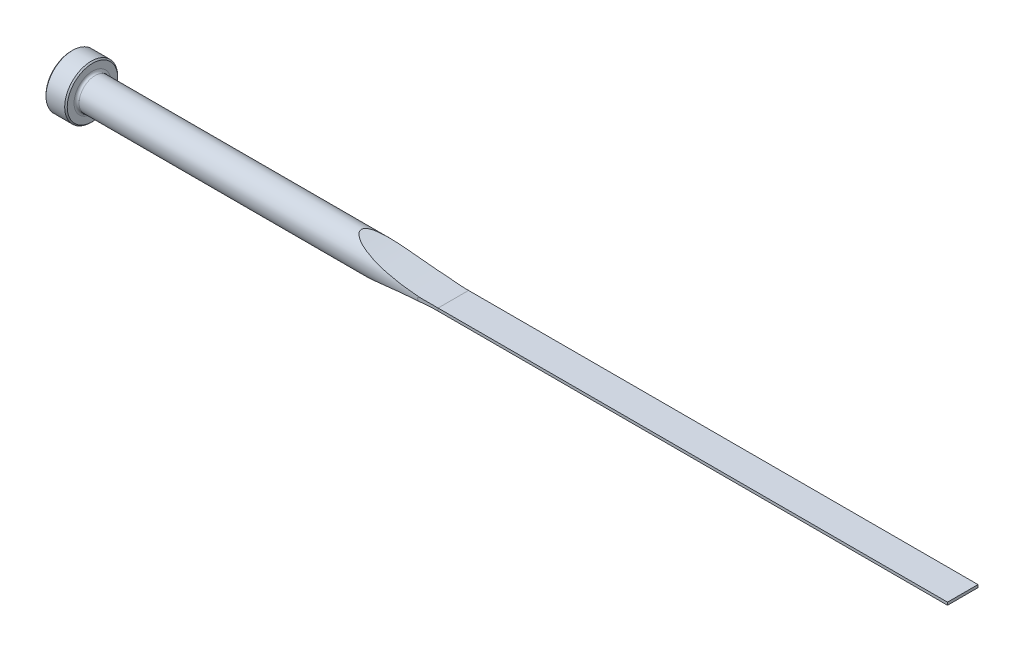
ISO-10303-21;
HEADER;
FILE_DESCRIPTION(('STEP AP214'),'2;1');
FILE_NAME('part.step','',(''),(''),'','','');
FILE_SCHEMA(('AUTOMOTIVE_DESIGN { 1 0 10303 214 1 1 1 1 }'));
ENDSEC;
DATA;
#1=APPLICATION_CONTEXT('core data for automotive mechanical design processes');
#2=APPLICATION_PROTOCOL_DEFINITION('international standard','automotive_design',2000,#1);
#3=PRODUCT_CONTEXT('',#1,'mechanical');
#4=PRODUCT('Part','Part','',(#3));
#5=PRODUCT_RELATED_PRODUCT_CATEGORY('part','',(#4));
#6=PRODUCT_DEFINITION_FORMATION('','',#4);
#7=PRODUCT_DEFINITION_CONTEXT('part definition',#1,'design');
#8=PRODUCT_DEFINITION('design','',#6,#7);
#9=PRODUCT_DEFINITION_SHAPE('','',#8);
#10=(LENGTH_UNIT() NAMED_UNIT(*) SI_UNIT(.MILLI.,.METRE.));
#11=(NAMED_UNIT(*) PLANE_ANGLE_UNIT() SI_UNIT($,.RADIAN.));
#12=(NAMED_UNIT(*) SI_UNIT($,.STERADIAN.) SOLID_ANGLE_UNIT());
#13=UNCERTAINTY_MEASURE_WITH_UNIT(LENGTH_MEASURE(1.E-05),#10,'distance_accuracy_value','');
#14=(GEOMETRIC_REPRESENTATION_CONTEXT(3) GLOBAL_UNCERTAINTY_ASSIGNED_CONTEXT((#13)) GLOBAL_UNIT_ASSIGNED_CONTEXT((#10,
#11,#12)) REPRESENTATION_CONTEXT('',''));
#15=CARTESIAN_POINT('',(0.,0.,0.));
#16=DIRECTION('',(0.,0.,1.));
#17=DIRECTION('',(1.,0.,0.));
#18=AXIS2_PLACEMENT_3D('',#15,#16,#17);
#19=CARTESIAN_POINT('',(0.,0.,0.));
#20=DIRECTION('',(-1.,0.,0.));
#21=DIRECTION('',(0.,0.,1.));
#22=AXIS2_PLACEMENT_3D('',#19,#20,#21);
#23=CYLINDRICAL_SURFACE('',#22,4.7625);
#24=CARTESIAN_POINT('',(7.112,0.,0.));
#25=DIRECTION('',(-1.,0.,0.));
#26=DIRECTION('',(0.,0.,1.));
#27=AXIS2_PLACEMENT_3D('',#24,#25,#26);
#28=CIRCLE('',#27,4.7625);
#29=CARTESIAN_POINT('',(7.112,0.,4.7625));
#30=VERTEX_POINT('',#29);
#31=EDGE_CURVE('E153',#30,#30,#28,.F.);
#32=ORIENTED_EDGE('',*,*,#31,.T.);
#33=EDGE_LOOP('',(#32));
#34=FACE_BOUND('',#33,.T.);
#35=CARTESIAN_POINT('',(114.3,1.37629566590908,4.55929999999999));
#36=CARTESIAN_POINT('',(114.100243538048,1.37627017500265,4.55929946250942));
#37=CARTESIAN_POINT('',(113.900483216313,1.37406392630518,4.55997325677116));
#38=CARTESIAN_POINT('',(113.501024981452,1.36511039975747,4.56266611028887));
#39=CARTESIAN_POINT('',(113.301327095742,1.35836200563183,4.56468550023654));
#40=CARTESIAN_POINT('',(112.900347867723,1.34006170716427,4.57009060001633));
#41=CARTESIAN_POINT('',(112.699068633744,1.32846669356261,4.57348856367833));
#42=CARTESIAN_POINT('',(112.296928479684,1.30007175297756,4.58164172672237));
#43=CARTESIAN_POINT('',(112.096067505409,1.28327254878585,4.58639673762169));
#44=CARTESIAN_POINT('',(111.696176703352,1.24395343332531,4.59721659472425));
#45=CARTESIAN_POINT('',(111.497143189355,1.22146913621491,4.60327325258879));
#46=CARTESIAN_POINT('',(111.099904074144,1.16973426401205,4.6166926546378));
#47=CARTESIAN_POINT('',(110.90169881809,1.1404811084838,4.62405589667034));
#48=CARTESIAN_POINT('',(110.507485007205,1.07370926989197,4.640013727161));
#49=CARTESIAN_POINT('',(110.311471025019,1.03622172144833,4.64860363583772));
#50=CARTESIAN_POINT('',(109.921964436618,0.950234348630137,4.66695416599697));
#51=CARTESIAN_POINT('',(109.728469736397,0.901744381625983,4.67671373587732));
#52=CARTESIAN_POINT('',(109.489568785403,0.830609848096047,4.68952997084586));
#53=CARTESIAN_POINT('',(109.441796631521,0.815810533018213,4.69213189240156));
#54=CARTESIAN_POINT('',(109.346645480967,0.784967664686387,4.69739068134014));
#55=CARTESIAN_POINT('',(109.29926657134,0.768923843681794,4.70004756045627));
#56=CARTESIAN_POINT('',(109.157175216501,0.71840494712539,4.70812874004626));
#57=CARTESIAN_POINT('',(109.063234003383,0.681752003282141,4.71362458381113));
#58=CARTESIAN_POINT('',(108.877534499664,0.599731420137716,4.72477713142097));
#59=CARTESIAN_POINT('',(108.785820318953,0.554256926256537,4.73043499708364));
#60=CARTESIAN_POINT('',(108.654614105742,0.476034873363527,4.73871868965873));
#61=CARTESIAN_POINT('',(108.612099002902,0.448424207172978,4.7414354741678));
#62=CARTESIAN_POINT('',(108.530424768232,0.388667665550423,4.74670987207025));
#63=CARTESIAN_POINT('',(108.491254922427,0.35653721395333,4.74926798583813));
#64=CARTESIAN_POINT('',(108.434384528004,0.301094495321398,4.75301502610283));
#65=CARTESIAN_POINT('',(108.414664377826,0.279884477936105,4.75432176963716));
#66=CARTESIAN_POINT('',(108.378171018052,0.235020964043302,4.75675058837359));
#67=CARTESIAN_POINT('',(108.361393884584,0.211370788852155,4.75787290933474));
#68=CARTESIAN_POINT('',(108.336135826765,0.16808537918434,4.75956809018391));
#69=CARTESIAN_POINT('',(108.326635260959,0.149056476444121,4.76020769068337));
#70=CARTESIAN_POINT('',(108.31078402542,0.109713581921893,4.76127659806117));
#71=CARTESIAN_POINT('',(108.304429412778,0.0894012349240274,4.76170616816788));
#72=CARTESIAN_POINT('',(108.295545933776,0.0476995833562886,4.76230708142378));
#73=CARTESIAN_POINT('',(108.293058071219,0.0263011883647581,4.76247565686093));
#74=CARTESIAN_POINT('',(108.292412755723,-0.0165581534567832,4.76251936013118));
#75=CARTESIAN_POINT('',(108.294253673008,-0.0380190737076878,4.76239459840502));
#76=CARTESIAN_POINT('',(108.30142234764,-0.0771509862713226,4.76190953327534));
#77=CARTESIAN_POINT('',(108.306214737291,-0.0949256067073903,4.76158540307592));
#78=CARTESIAN_POINT('',(108.318318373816,-0.129583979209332,4.76076832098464));
#79=CARTESIAN_POINT('',(108.325631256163,-0.146467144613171,4.76027525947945));
#80=CARTESIAN_POINT('',(108.347823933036,-0.190109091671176,4.75878258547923));
#81=CARTESIAN_POINT('',(108.364497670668,-0.21594512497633,4.75766444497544));
#82=CARTESIAN_POINT('',(108.401515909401,-0.264813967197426,4.75519504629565));
#83=CARTESIAN_POINT('',(108.421871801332,-0.287837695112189,4.75384306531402));
#84=CARTESIAN_POINT('',(108.486246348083,-0.353109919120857,4.74959319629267));
#85=CARTESIAN_POINT('',(108.5337556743,-0.391849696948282,4.74648889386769));
#86=CARTESIAN_POINT('',(108.633252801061,-0.462955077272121,4.74007706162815));
#87=CARTESIAN_POINT('',(108.685255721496,-0.495297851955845,4.73676885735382));
#88=CARTESIAN_POINT('',(108.832460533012,-0.57848482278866,4.72754240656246));
#89=CARTESIAN_POINT('',(108.930312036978,-0.624585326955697,4.72156110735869));
#90=CARTESIAN_POINT('',(109.129656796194,-0.708279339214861,4.70972175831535));
#91=CARTESIAN_POINT('',(109.231158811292,-0.745850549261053,4.70386406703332));
#92=CARTESIAN_POINT('',(109.437175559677,-0.815246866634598,4.69233729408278));
#93=CARTESIAN_POINT('',(109.54170965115,-0.847014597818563,4.68667050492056));
#94=CARTESIAN_POINT('',(109.751931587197,-0.905852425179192,4.67565197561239));
#95=CARTESIAN_POINT('',(109.857617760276,-0.93292855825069,4.67029983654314));
#96=CARTESIAN_POINT('',(110.147207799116,-1.00180171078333,4.65615804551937));
#97=CARTESIAN_POINT('',(110.331993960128,-1.03994988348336,4.64770520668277));
#98=CARTESIAN_POINT('',(110.703115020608,-1.10820041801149,4.63190013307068));
#99=CARTESIAN_POINT('',(110.889450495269,-1.13829964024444,4.62454832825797));
#100=CARTESIAN_POINT('',(111.263496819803,-1.19209136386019,4.61097562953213));
#101=CARTESIAN_POINT('',(111.451209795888,-1.21576959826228,4.60475726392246));
#102=CARTESIAN_POINT('',(111.827286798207,-1.25764094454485,4.5934961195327));
#103=CARTESIAN_POINT('',(112.015650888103,-1.27583350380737,4.58845345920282));
#104=CARTESIAN_POINT('',(112.553477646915,-1.32086317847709,4.5757714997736));
#105=CARTESIAN_POINT('',(112.903477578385,-1.34186157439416,4.56957976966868));
#106=CARTESIAN_POINT('',(113.428033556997,-1.36263417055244,4.56340533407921));
#107=CARTESIAN_POINT('',(113.602391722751,-1.3677712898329,4.56186604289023));
#108=CARTESIAN_POINT('',(113.951163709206,-1.37459791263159,4.55981341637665));
#109=CARTESIAN_POINT('',(114.125577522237,-1.37628777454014,4.55929997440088));
#110=CARTESIAN_POINT('',(114.3,-1.37629566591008,4.55929999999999));
#111=B_SPLINE_CURVE_WITH_KNOTS('',3,(#35,#36,#37,#38,#39,#40,#41,#42,#43,#44,#45,#46,#47,#48,
#49,#50,#51,#52,#53,#54,#55,#56,#57,#58,#59,#60,#61,#62,#63,#64,#65,#66,#67,#68,#69,#70,#71,#72,
#73,#74,#75,#76,#77,#78,#79,#80,#81,#82,#83,#84,#85,#86,#87,#88,#89,#90,#91,#92,#93,#94,#95,#96,
#97,#98,#99,#100,#101,#102,#103,#104,#105,#106,#107,#108,#109,#110),.UNSPECIFIED.,.F.,.F.,(4,2,
2,2,2,2,2,2,2,2,2,2,2,2,2,2,2,2,2,2,2,2,2,2,2,2,2,2,2,2,2,2,2,2,2,2,2,4),(0.,0.599262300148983,
1.19867192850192,1.80353056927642,2.40830524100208,3.00938132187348,3.61068692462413,
4.20975694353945,4.80829234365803,4.95851786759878,5.10877580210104,5.41155733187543,
5.71826557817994,5.87039269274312,6.02201272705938,6.10881533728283,6.19550132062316,
6.2591195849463,6.32265791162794,6.38686552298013,6.45104896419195,6.50606849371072,
6.56112379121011,6.65289509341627,6.74495530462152,6.92807013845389,7.11182707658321,
7.43597686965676,7.76096456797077,8.08900931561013,8.41662876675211,8.98296372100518,
9.54951926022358,10.117323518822,10.6851849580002,11.7368092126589,12.26010406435,
12.7833445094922),.UNSPECIFIED.);
#112=CARTESIAN_POINT('',(108.830915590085,0.574787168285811,4.72768716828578));
#113=VERTEX_POINT('',#112);
#114=CARTESIAN_POINT('',(108.830915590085,-0.574787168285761,4.72768716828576));
#115=VERTEX_POINT('',#114);
#116=EDGE_CURVE('E156',#113,#115,#111,.T.);
#117=ORIENTED_EDGE('',*,*,#116,.F.);
#118=CARTESIAN_POINT('',(114.3,0.406399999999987,4.74512858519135));
#119=CARTESIAN_POINT('',(113.90267450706,0.406399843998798,4.7451190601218));
#120=CARTESIAN_POINT('',(113.505349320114,0.409063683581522,4.74490020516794));
#121=CARTESIAN_POINT('',(112.710770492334,0.419718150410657,4.74397463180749));
#122=CARTESIAN_POINT('',(112.313516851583,0.427708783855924,4.74326791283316));
#123=CARTESIAN_POINT('',(111.519127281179,0.449016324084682,4.74129734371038));
#124=CARTESIAN_POINT('',(111.121991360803,0.462333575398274,4.74003345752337));
#125=CARTESIAN_POINT('',(110.327939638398,0.494291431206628,4.73680639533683));
#126=CARTESIAN_POINT('',(109.931023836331,0.512932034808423,4.73484321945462));
#127=CARTESIAN_POINT('',(108.739456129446,0.576901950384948,4.72763012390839));
#128=CARTESIAN_POINT('',(107.945225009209,0.63024609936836,4.72105865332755));
#129=CARTESIAN_POINT('',(106.358589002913,0.758235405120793,4.70219684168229));
#130=CARTESIAN_POINT('',(105.56618404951,0.832879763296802,4.68990671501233));
#131=CARTESIAN_POINT('',(103.983552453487,1.00343011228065,4.65640758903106));
#132=CARTESIAN_POINT('',(103.193326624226,1.09934317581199,4.63519562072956));
#133=CARTESIAN_POINT('',(102.010444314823,1.25905368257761,4.59338453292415));
#134=CARTESIAN_POINT('',(101.616527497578,1.31493588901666,4.57778029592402));
#135=CARTESIAN_POINT('',(100.829658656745,1.43195490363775,4.54253855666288));
#136=CARTESIAN_POINT('',(100.436706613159,1.4930916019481,4.52290113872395));
#137=CARTESIAN_POINT('',(99.6518575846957,1.62059720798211,4.47879686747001));
#138=CARTESIAN_POINT('',(99.2599607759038,1.68696693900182,4.45432925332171));
#139=CARTESIAN_POINT('',(98.4774903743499,1.82488195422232,4.39962705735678));
#140=CARTESIAN_POINT('',(98.0869167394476,1.89642707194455,4.36939266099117));
#141=CARTESIAN_POINT('',(97.3074212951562,2.04461214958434,4.30204521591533));
#142=CARTESIAN_POINT('',(96.9184991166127,2.12125089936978,4.26493379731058));
#143=CARTESIAN_POINT('',(96.1425664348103,2.27953993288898,4.18247202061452));
#144=CARTESIAN_POINT('',(95.7555558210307,2.3611899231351,4.13712214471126));
#145=CARTESIAN_POINT('',(94.9831933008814,2.52951682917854,4.03640907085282));
#146=CARTESIAN_POINT('',(94.5978455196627,2.61620235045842,3.98102836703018));
#147=CARTESIAN_POINT('',(93.8301002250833,2.79427071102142,3.858130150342));
#148=CARTESIAN_POINT('',(93.447703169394,2.88565426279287,3.79061079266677));
#149=CARTESIAN_POINT('',(92.6876227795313,3.07260204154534,3.64072869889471));
#150=CARTESIAN_POINT('',(92.3099315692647,3.16815757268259,3.55839581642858));
#151=CARTESIAN_POINT('',(91.7476753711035,3.31430622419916,3.4207048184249));
#152=CARTESIAN_POINT('',(91.5609951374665,3.36348479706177,3.37245005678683));
#153=CARTESIAN_POINT('',(91.1893485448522,3.46267714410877,3.27052654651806));
#154=CARTESIAN_POINT('',(91.0043820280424,3.51269084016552,3.21685830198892));
#155=CARTESIAN_POINT('',(90.6792293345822,3.60172890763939,3.1164639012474));
#156=CARTESIAN_POINT('',(90.5386096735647,3.64061088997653,3.07101578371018));
#157=CARTESIAN_POINT('',(90.2588579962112,3.71869891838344,2.97598216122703));
#158=CARTESIAN_POINT('',(90.1197259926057,3.75790496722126,2.9263966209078));
#159=CARTESIAN_POINT('',(89.8431177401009,3.83657136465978,2.82247755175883));
#160=CARTESIAN_POINT('',(89.7056435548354,3.87603195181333,2.76813868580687));
#161=CARTESIAN_POINT('',(89.4329587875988,3.95500631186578,2.65408085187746));
#162=CARTESIAN_POINT('',(89.2977480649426,3.99452008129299,2.59436221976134));
#163=CARTESIAN_POINT('',(89.0292960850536,4.07365258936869,2.46826704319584));
#164=CARTESIAN_POINT('',(88.8960740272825,4.11327026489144,2.40184867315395));
#165=CARTESIAN_POINT('',(88.6333710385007,4.19204775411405,2.26155326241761));
#166=CARTESIAN_POINT('',(88.5038915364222,4.23120738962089,2.18767342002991));
#167=CARTESIAN_POINT('',(88.2499378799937,4.30862416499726,2.03096404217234));
#168=CARTESIAN_POINT('',(88.1254689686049,4.34688034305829,1.94812545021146));
#169=CARTESIAN_POINT('',(87.8838358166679,4.42170051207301,1.77176900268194));
#170=CARTESIAN_POINT('',(87.7666646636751,4.45826609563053,1.67826149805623));
#171=CARTESIAN_POINT('',(87.5877199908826,4.51448373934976,1.51817747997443));
#172=CARTESIAN_POINT('',(87.5225277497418,4.53505298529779,1.45578096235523));
#173=CARTESIAN_POINT('',(87.3971449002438,4.57476044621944,1.32575175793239));
#174=CARTESIAN_POINT('',(87.3369568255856,4.5938979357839,1.25811645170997));
#175=CARTESIAN_POINT('',(87.1668727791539,4.64816205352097,1.04732254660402));
#176=CARTESIAN_POINT('',(87.0661556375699,4.68055066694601,0.895181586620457));
#177=CARTESIAN_POINT('',(86.9489814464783,4.7183777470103,0.651766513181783));
#178=CARTESIAN_POINT('',(86.9158107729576,4.72911592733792,0.569337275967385));
#179=CARTESIAN_POINT('',(86.8623594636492,4.74644103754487,0.399912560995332));
#180=CARTESIAN_POINT('',(86.8420697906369,4.75303087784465,0.312920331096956));
#181=CARTESIAN_POINT('',(86.8163479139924,4.76138789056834,0.135923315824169));
#182=CARTESIAN_POINT('',(86.8110091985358,4.76312471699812,0.0459031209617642));
#183=CARTESIAN_POINT('',(86.8160954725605,4.76147114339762,-0.13364533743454));
#184=CARTESIAN_POINT('',(86.8265224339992,4.75808010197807,-0.223173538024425));
#185=CARTESIAN_POINT('',(86.8607143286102,4.74697779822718,-0.392888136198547));
#186=CARTESIAN_POINT('',(86.8835203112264,4.73957720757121,-0.473295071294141));
#187=CARTESIAN_POINT('',(86.9398597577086,4.72133273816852,-0.629795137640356));
#188=CARTESIAN_POINT('',(86.973398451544,4.71048718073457,-0.705886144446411));
#189=CARTESIAN_POINT('',(87.0738381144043,4.67809283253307,-0.901152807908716));
#190=CARTESIAN_POINT('',(87.1482314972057,4.65417680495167,-1.01606031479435));
#191=CARTESIAN_POINT('',(87.3128356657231,4.60155676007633,-1.23272194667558));
#192=CARTESIAN_POINT('',(87.4030978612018,4.57283719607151,-1.33443139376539));
#193=CARTESIAN_POINT('',(87.5883758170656,4.51425401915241,-1.52046591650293));
#194=CARTESIAN_POINT('',(87.6827773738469,4.48456363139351,-1.60546923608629));
#195=CARTESIAN_POINT('',(87.8782410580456,4.42347381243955,-1.76684360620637));
#196=CARTESIAN_POINT('',(87.9793094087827,4.39207278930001,-1.84320640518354));
#197=CARTESIAN_POINT('',(88.1864508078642,4.32814203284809,-1.98869631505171));
#198=CARTESIAN_POINT('',(88.2925332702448,4.29561020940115,-2.05780896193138));
#199=CARTESIAN_POINT('',(88.508284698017,4.22990413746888,-2.18968796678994));
#200=CARTESIAN_POINT('',(88.6179522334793,4.19673014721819,-2.25245681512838));
#201=CARTESIAN_POINT('',(88.9008694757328,4.11176216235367,-2.40544145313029));
#202=CARTESIAN_POINT('',(89.0760784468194,4.05971107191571,-2.49188484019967));
#203=CARTESIAN_POINT('',(89.4312638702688,3.95541706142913,-2.65431239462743));
#204=CARTESIAN_POINT('',(89.6112427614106,3.90317405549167,-2.73029108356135));
#205=CARTESIAN_POINT('',(89.9750027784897,3.7988542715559,-2.87367043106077));
#206=CARTESIAN_POINT('',(90.1587900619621,3.74677795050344,-2.94105569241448));
#207=CARTESIAN_POINT('',(90.5290553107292,3.64316890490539,-3.06846263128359));
#208=CARTESIAN_POINT('',(90.7155335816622,3.59163624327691,-3.12848346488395));
#209=CARTESIAN_POINT('',(91.0915924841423,3.48904737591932,-3.24250897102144));
#210=CARTESIAN_POINT('',(91.2811843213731,3.43799514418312,-3.29648006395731));
#211=CARTESIAN_POINT('',(91.6620944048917,3.3367886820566,-3.39888617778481));
#212=CARTESIAN_POINT('',(91.8534127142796,3.28663448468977,-3.44732099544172));
#213=CARTESIAN_POINT('',(92.23723688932,3.18739089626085,-3.5392819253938));
#214=CARTESIAN_POINT('',(92.4297410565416,3.13830030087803,-3.58281385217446));
#215=CARTESIAN_POINT('',(92.8159311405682,3.04120169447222,-3.66559149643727));
#216=CARTESIAN_POINT('',(93.0096170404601,2.9931936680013,-3.70483727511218));
#217=CARTESIAN_POINT('',(93.5916930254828,2.85100463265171,-3.8167745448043));
#218=CARTESIAN_POINT('',(93.9815995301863,2.75852978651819,-3.88378247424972));
#219=CARTESIAN_POINT('',(94.7644614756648,2.57846824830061,-4.00558232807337));
#220=CARTESIAN_POINT('',(95.1574174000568,2.49088235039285,-4.0603722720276));
#221=CARTESIAN_POINT('',(95.9458992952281,2.32077052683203,-4.15994533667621));
#222=CARTESIAN_POINT('',(96.3414265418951,2.23824736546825,-4.20472302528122));
#223=CARTESIAN_POINT('',(97.1343932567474,2.07844836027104,-4.28596381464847));
#224=CARTESIAN_POINT('',(97.5318327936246,2.00117270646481,-4.32242661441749));
#225=CARTESIAN_POINT('',(98.3292695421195,1.85177898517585,-4.38850836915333));
#226=CARTESIAN_POINT('',(98.7292706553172,1.77967421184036,-4.41811009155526));
#227=CARTESIAN_POINT('',(99.5306003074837,1.6408983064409,-4.47150793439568));
#228=CARTESIAN_POINT('',(99.9319288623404,1.57422723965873,-4.49530398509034));
#229=CARTESIAN_POINT('',(100.735588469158,1.44638497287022,-4.53805236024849));
#230=CARTESIAN_POINT('',(101.137919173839,1.38521208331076,-4.55700617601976));
#231=CARTESIAN_POINT('',(101.943551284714,1.26837488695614,-4.59089528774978));
#232=CARTESIAN_POINT('',(102.346852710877,1.21271069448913,-4.60583050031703));
#233=CARTESIAN_POINT('',(103.557312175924,1.05411059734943,-4.64566605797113));
#234=CARTESIAN_POINT('',(104.365732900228,0.95945461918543,-4.6656313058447));
#235=CARTESIAN_POINT('',(105.985067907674,0.792364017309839,-4.69688739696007));
#236=CARTESIAN_POINT('',(106.795982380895,0.719931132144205,-4.70817756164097));
#237=CARTESIAN_POINT('',(108.418528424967,0.597441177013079,-4.72528178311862));
#238=CARTESIAN_POINT('',(109.230157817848,0.547356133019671,-4.731102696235));
#239=CARTESIAN_POINT('',(110.854446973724,0.469475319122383,-4.73946638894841));
#240=CARTESIAN_POINT('',(111.66710664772,0.441677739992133,-4.74200943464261));
#241=CARTESIAN_POINT('',(112.783415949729,0.418818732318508,-4.74405084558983));
#242=CARTESIAN_POINT('',(113.086890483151,0.414159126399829,-4.7444585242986));
#243=CARTESIAN_POINT('',(113.693575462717,0.407951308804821,-4.74499664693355));
#244=CARTESIAN_POINT('',(113.996785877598,0.406400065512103,-4.7451273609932));
#245=CARTESIAN_POINT('',(114.3,0.40639999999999,-4.74512858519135));
#246=B_SPLINE_CURVE_WITH_KNOTS('',3,(#118,#119,#120,#121,#122,#123,#124,#125,#126,#127,#128,
#129,#130,#131,#132,#133,#134,#135,#136,#137,#138,#139,#140,#141,#142,#143,#144,#145,#146,#147,
#148,#149,#150,#151,#152,#153,#154,#155,#156,#157,#158,#159,#160,#161,#162,#163,#164,#165,#166,
#167,#168,#169,#170,#171,#172,#173,#174,#175,#176,#177,#178,#179,#180,#181,#182,#183,#184,#185,
#186,#187,#188,#189,#190,#191,#192,#193,#194,#195,#196,#197,#198,#199,#200,#201,#202,#203,#204,
#205,#206,#207,#208,#209,#210,#211,#212,#213,#214,#215,#216,#217,#218,#219,#220,#221,#222,#223,
#224,#225,#226,#227,#228,#229,#230,#231,#232,#233,#234,#235,#236,#237,#238,#239,#240,#241,#242,
#243,#244,#245),.UNSPECIFIED.,.F.,.F.,(4,2,2,2,2,2,2,2,2,2,2,2,2,2,2,2,2,2,2,2,2,2,2,2,2,2,2,2,
2,2,2,2,2,2,2,2,2,2,2,2,2,2,2,2,2,2,2,2,2,2,2,2,2,2,2,2,2,2,2,2,2,2,2,4),(0.,1.19196684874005,
2.3839350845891,3.57598043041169,4.76802557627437,7.15583924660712,9.54356340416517,
11.9320827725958,13.1265378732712,14.3209680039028,15.5155864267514,16.7101664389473,
17.9044636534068,19.0986909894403,20.2950229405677,21.4915368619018,22.6856659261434,
23.282568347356,23.8794152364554,24.3377948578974,24.7961783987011,25.2550833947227,
25.7139597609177,26.175902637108,26.6380196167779,27.1006082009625,27.562751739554,
27.8401229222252,28.117633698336,28.6674621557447,28.9350509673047,29.2024518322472,
29.4715210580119,29.7406239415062,29.9913593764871,30.2422171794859,30.6566912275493,
31.0725336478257,31.4633177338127,31.8544719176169,32.2463921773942,32.6381579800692,
33.2442660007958,33.850690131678,34.4581859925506,35.0657514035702,35.6765376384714,
36.2873462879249,36.8974227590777,37.5074905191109,38.726044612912,39.944796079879,
41.1642071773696,42.3836624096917,43.6061480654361,44.82864840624,46.0507717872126,
47.2729205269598,49.7150672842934,52.1574050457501,54.5966769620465,57.0357508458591,
57.9462702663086,58.8559012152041),.UNSPECIFIED.);
#247=CARTESIAN_POINT('',(108.830915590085,0.574787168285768,-4.72768716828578));
#248=VERTEX_POINT('',#247);
#249=EDGE_CURVE('E106',#113,#248,#246,.T.);
#250=ORIENTED_EDGE('',*,*,#249,.T.);
#251=CARTESIAN_POINT('',(114.3,1.37629566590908,-4.55929999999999));
#252=CARTESIAN_POINT('',(114.100243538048,1.3762701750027,-4.5592994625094));
#253=CARTESIAN_POINT('',(113.900483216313,1.37406392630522,-4.55997325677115));
#254=CARTESIAN_POINT('',(113.501024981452,1.36511039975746,-4.56266611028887));
#255=CARTESIAN_POINT('',(113.301327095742,1.35836200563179,-4.56468550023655));
#256=CARTESIAN_POINT('',(112.900347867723,1.34006170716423,-4.57009060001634));
#257=CARTESIAN_POINT('',(112.699068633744,1.32846669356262,-4.57348856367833));
#258=CARTESIAN_POINT('',(112.296928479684,1.3000717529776,-4.58164172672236));
#259=CARTESIAN_POINT('',(112.096067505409,1.28327254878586,-4.58639673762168));
#260=CARTESIAN_POINT('',(111.696176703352,1.2439534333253,-4.59721659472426));
#261=CARTESIAN_POINT('',(111.497143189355,1.22146913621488,-4.6032732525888));
#262=CARTESIAN_POINT('',(111.099904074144,1.16973426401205,-4.61669265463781));
#263=CARTESIAN_POINT('',(110.90169881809,1.14048110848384,-4.62405589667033));
#264=CARTESIAN_POINT('',(110.507485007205,1.07370926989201,-4.64001372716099));
#265=CARTESIAN_POINT('',(110.311471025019,1.03622172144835,-4.64860363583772));
#266=CARTESIAN_POINT('',(109.921964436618,0.950234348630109,-4.66695416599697));
#267=CARTESIAN_POINT('',(109.728469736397,0.901744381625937,-4.67671373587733));
#268=CARTESIAN_POINT('',(109.489568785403,0.830609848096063,-4.68952997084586));
#269=CARTESIAN_POINT('',(109.441796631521,0.815810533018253,-4.69213189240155));
#270=CARTESIAN_POINT('',(109.346645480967,0.784967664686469,-4.69739068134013));
#271=CARTESIAN_POINT('',(109.29926657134,0.768923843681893,-4.70004756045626));
#272=CARTESIAN_POINT('',(109.157175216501,0.718404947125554,-4.70812874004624));
#273=CARTESIAN_POINT('',(109.063234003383,0.681752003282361,-4.7136245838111));
#274=CARTESIAN_POINT('',(108.877534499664,0.59973142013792,-4.72477713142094));
#275=CARTESIAN_POINT('',(108.785820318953,0.554256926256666,-4.73043499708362));
#276=CARTESIAN_POINT('',(108.654614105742,0.476034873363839,-4.7387186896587));
#277=CARTESIAN_POINT('',(108.612099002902,0.448424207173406,-4.74143547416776));
#278=CARTESIAN_POINT('',(108.530424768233,0.388667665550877,-4.74670987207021));
#279=CARTESIAN_POINT('',(108.491254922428,0.35653721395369,-4.7492679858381));
#280=CARTESIAN_POINT('',(108.434384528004,0.301094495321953,-4.7530150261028));
#281=CARTESIAN_POINT('',(108.414664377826,0.279884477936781,-4.75432176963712));
#282=CARTESIAN_POINT('',(108.378171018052,0.235020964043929,-4.75675058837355));
#283=CARTESIAN_POINT('',(108.361393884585,0.211370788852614,-4.75787290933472));
#284=CARTESIAN_POINT('',(108.336135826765,0.168085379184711,-4.7595680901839));
#285=CARTESIAN_POINT('',(108.326635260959,0.149056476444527,-4.76020769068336));
#286=CARTESIAN_POINT('',(108.31078402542,0.109713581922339,-4.76127659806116));
#287=CARTESIAN_POINT('',(108.304429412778,0.08940123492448,-4.76170616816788));
#288=CARTESIAN_POINT('',(108.295545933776,0.0476995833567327,-4.76230708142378));
#289=CARTESIAN_POINT('',(108.293058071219,0.0263011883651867,-4.76247565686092));
#290=CARTESIAN_POINT('',(108.292412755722,-0.0165581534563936,-4.76251936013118));
#291=CARTESIAN_POINT('',(108.294253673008,-0.0380190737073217,-4.76239459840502));
#292=CARTESIAN_POINT('',(108.30142234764,-0.0771509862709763,-4.76190953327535));
#293=CARTESIAN_POINT('',(108.306214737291,-0.0949256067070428,-4.76158540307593));
#294=CARTESIAN_POINT('',(108.318318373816,-0.129583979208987,-4.76076832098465));
#295=CARTESIAN_POINT('',(108.325631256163,-0.146467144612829,-4.76027525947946));
#296=CARTESIAN_POINT('',(108.347823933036,-0.190109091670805,-4.75878258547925));
#297=CARTESIAN_POINT('',(108.364497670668,-0.215945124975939,-4.75766444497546));
#298=CARTESIAN_POINT('',(108.4015159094,-0.264813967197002,-4.75519504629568));
#299=CARTESIAN_POINT('',(108.421871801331,-0.287837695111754,-4.75384306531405));
#300=CARTESIAN_POINT('',(108.486246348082,-0.353109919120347,-4.74959319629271));
#301=CARTESIAN_POINT('',(108.5337556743,-0.391849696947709,-4.74648889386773));
#302=CARTESIAN_POINT('',(108.63325280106,-0.462955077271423,-4.74007706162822));
#303=CARTESIAN_POINT('',(108.685255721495,-0.495297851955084,-4.7367688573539));
#304=CARTESIAN_POINT('',(108.832460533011,-0.57848482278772,-4.72754240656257));
#305=CARTESIAN_POINT('',(108.930312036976,-0.62458532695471,-4.72156110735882));
#306=CARTESIAN_POINT('',(109.129656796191,-0.708279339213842,-4.7097217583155));
#307=CARTESIAN_POINT('',(109.231158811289,-0.745850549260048,-4.70386406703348));
#308=CARTESIAN_POINT('',(109.437175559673,-0.815246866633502,-4.69233729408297));
#309=CARTESIAN_POINT('',(109.541709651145,-0.847014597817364,-4.68667050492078));
#310=CARTESIAN_POINT('',(109.751931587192,-0.905852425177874,-4.67565197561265));
#311=CARTESIAN_POINT('',(109.857617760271,-0.932928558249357,-4.6702998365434));
#312=CARTESIAN_POINT('',(110.147207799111,-1.00180171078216,-4.65615804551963));
#313=CARTESIAN_POINT('',(110.331993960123,-1.03994988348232,-4.647705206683));
#314=CARTESIAN_POINT('',(110.703115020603,-1.10820041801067,-4.63190013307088));
#315=CARTESIAN_POINT('',(110.889450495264,-1.13829964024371,-4.62454832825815));
#316=CARTESIAN_POINT('',(111.263496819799,-1.19209136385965,-4.61097562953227));
#317=CARTESIAN_POINT('',(111.451209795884,-1.21576959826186,-4.60475726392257));
#318=CARTESIAN_POINT('',(111.827286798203,-1.25764094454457,-4.59349611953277));
#319=CARTESIAN_POINT('',(112.015650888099,-1.27583350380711,-4.58845345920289));
#320=CARTESIAN_POINT('',(112.553477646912,-1.32086317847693,-4.57577149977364));
#321=CARTESIAN_POINT('',(112.903477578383,-1.3418615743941,-4.5695797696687));
#322=CARTESIAN_POINT('',(113.428033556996,-1.36263417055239,-4.56340533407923));
#323=CARTESIAN_POINT('',(113.602391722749,-1.36777128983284,-4.56186604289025));
#324=CARTESIAN_POINT('',(113.951163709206,-1.37459791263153,-4.55981341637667));
#325=CARTESIAN_POINT('',(114.125577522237,-1.3762877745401,-4.55929997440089));
#326=CARTESIAN_POINT('',(114.3,-1.3762956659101,-4.55929999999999));
#327=B_SPLINE_CURVE_WITH_KNOTS('',3,(#251,#252,#253,#254,#255,#256,#257,#258,#259,#260,#261,
#262,#263,#264,#265,#266,#267,#268,#269,#270,#271,#272,#273,#274,#275,#276,#277,#278,#279,#280,
#281,#282,#283,#284,#285,#286,#287,#288,#289,#290,#291,#292,#293,#294,#295,#296,#297,#298,#299,
#300,#301,#302,#303,#304,#305,#306,#307,#308,#309,#310,#311,#312,#313,#314,#315,#316,#317,#318,
#319,#320,#321,#322,#323,#324,#325,#326),.UNSPECIFIED.,.F.,.F.,(4,2,2,2,2,2,2,2,2,2,2,2,2,2,2,2,
2,2,2,2,2,2,2,2,2,2,2,2,2,2,2,2,2,2,2,2,2,4),(0.,0.599262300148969,1.1986719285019,
1.80353056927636,2.40830524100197,3.0093813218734,3.61068692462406,4.20975694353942,
4.80829234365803,4.9585178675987,5.10877580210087,5.41155733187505,5.71826557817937,
5.87039269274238,6.02201272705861,6.10881533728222,6.19550132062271,6.2591195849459,
6.32265791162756,6.3868655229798,6.45104896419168,6.50606849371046,6.56112379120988,
6.65289509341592,6.74495530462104,6.92807013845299,7.11182707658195,7.43597686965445,
7.7609645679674,8.08900931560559,8.41662876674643,8.98296372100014,9.5495192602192,
10.1173235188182,10.6851849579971,11.7368092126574,12.2601040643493,12.7833445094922),.UNSPECIFIED.);
#328=CARTESIAN_POINT('',(108.830915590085,-0.574787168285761,-4.72768716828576));
#329=VERTEX_POINT('',#328);
#330=EDGE_CURVE('E175',#248,#329,#327,.T.);
#331=ORIENTED_EDGE('',*,*,#330,.T.);
#332=CARTESIAN_POINT('',(114.3,-0.406399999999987,4.74512858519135));
#333=CARTESIAN_POINT('',(113.90267450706,-0.406399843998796,4.7451190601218));
#334=CARTESIAN_POINT('',(113.505349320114,-0.409063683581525,4.74490020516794));
#335=CARTESIAN_POINT('',(112.710770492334,-0.419718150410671,4.74397463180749));
#336=CARTESIAN_POINT('',(112.313516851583,-0.427708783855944,4.74326791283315));
#337=CARTESIAN_POINT('',(111.519127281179,-0.449016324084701,4.74129734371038));
#338=CARTESIAN_POINT('',(111.121991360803,-0.462333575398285,4.74003345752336));
#339=CARTESIAN_POINT('',(110.327939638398,-0.494291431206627,4.73680639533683));
#340=CARTESIAN_POINT('',(109.931023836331,-0.512932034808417,4.73484321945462));
#341=CARTESIAN_POINT('',(108.739456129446,-0.576901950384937,4.72763012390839));
#342=CARTESIAN_POINT('',(107.945225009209,-0.630246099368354,4.72105865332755));
#343=CARTESIAN_POINT('',(106.358589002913,-0.758235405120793,4.70219684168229));
#344=CARTESIAN_POINT('',(105.56618404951,-0.832879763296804,4.68990671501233));
#345=CARTESIAN_POINT('',(103.983552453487,-1.00343011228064,4.65640758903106));
#346=CARTESIAN_POINT('',(103.193326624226,-1.09934317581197,4.63519562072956));
#347=CARTESIAN_POINT('',(102.010444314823,-1.25905368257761,4.59338453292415));
#348=CARTESIAN_POINT('',(101.616527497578,-1.31493588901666,4.57778029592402));
#349=CARTESIAN_POINT('',(100.829658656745,-1.43195490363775,4.54253855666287));
#350=CARTESIAN_POINT('',(100.436706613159,-1.49309160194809,4.52290113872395));
#351=CARTESIAN_POINT('',(99.6518575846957,-1.6205972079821,4.47879686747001));
#352=CARTESIAN_POINT('',(99.2599607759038,-1.68696693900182,4.45432925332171));
#353=CARTESIAN_POINT('',(98.4774903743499,-1.82488195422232,4.39962705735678));
#354=CARTESIAN_POINT('',(98.0869167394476,-1.89642707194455,4.36939266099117));
#355=CARTESIAN_POINT('',(97.3074212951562,-2.04461214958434,4.30204521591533));
#356=CARTESIAN_POINT('',(96.9184991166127,-2.12125089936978,4.26493379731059));
#357=CARTESIAN_POINT('',(96.1425664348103,-2.27953993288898,4.18247202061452));
#358=CARTESIAN_POINT('',(95.7555558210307,-2.36118992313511,4.13712214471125));
#359=CARTESIAN_POINT('',(94.9831933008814,-2.52951682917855,4.03640907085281));
#360=CARTESIAN_POINT('',(94.5978455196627,-2.61620235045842,3.98102836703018));
#361=CARTESIAN_POINT('',(93.8301002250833,-2.79427071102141,3.85813015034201));
#362=CARTESIAN_POINT('',(93.447703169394,-2.88565426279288,3.79061079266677));
#363=CARTESIAN_POINT('',(92.6876227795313,-3.07260204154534,3.6407286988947));
#364=CARTESIAN_POINT('',(92.3099315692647,-3.1681575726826,3.55839581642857));
#365=CARTESIAN_POINT('',(91.7476753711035,-3.31430622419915,3.42070481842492));
#366=CARTESIAN_POINT('',(91.5609951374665,-3.36348479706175,3.37245005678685));
#367=CARTESIAN_POINT('',(91.1893485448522,-3.46267714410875,3.27052654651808));
#368=CARTESIAN_POINT('',(91.0043820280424,-3.51269084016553,3.21685830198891));
#369=CARTESIAN_POINT('',(90.6792293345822,-3.60172890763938,3.1164639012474));
#370=CARTESIAN_POINT('',(90.5386096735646,-3.64061088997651,3.07101578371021));
#371=CARTESIAN_POINT('',(90.2588579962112,-3.71869891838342,2.97598216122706));
#372=CARTESIAN_POINT('',(90.1197259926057,-3.75790496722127,2.9263966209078));
#373=CARTESIAN_POINT('',(89.8431177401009,-3.8365713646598,2.82247755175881));
#374=CARTESIAN_POINT('',(89.7056435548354,-3.87603195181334,2.76813868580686));
#375=CARTESIAN_POINT('',(89.4329587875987,-3.95500631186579,2.65408085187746));
#376=CARTESIAN_POINT('',(89.2977480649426,-3.99452008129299,2.59436221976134));
#377=CARTESIAN_POINT('',(89.0292960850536,-4.07365258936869,2.46826704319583));
#378=CARTESIAN_POINT('',(88.8960740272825,-4.11327026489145,2.40184867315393));
#379=CARTESIAN_POINT('',(88.6333710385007,-4.19204775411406,2.26155326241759));
#380=CARTESIAN_POINT('',(88.5038915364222,-4.23120738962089,2.18767342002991));
#381=CARTESIAN_POINT('',(88.2499378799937,-4.30862416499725,2.03096404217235));
#382=CARTESIAN_POINT('',(88.1254689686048,-4.34688034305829,1.94812545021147));
#383=CARTESIAN_POINT('',(87.8838358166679,-4.42170051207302,1.77176900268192));
#384=CARTESIAN_POINT('',(87.7666646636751,-4.45826609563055,1.67826149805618));
#385=CARTESIAN_POINT('',(87.5877199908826,-4.51448373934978,1.51817747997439));
#386=CARTESIAN_POINT('',(87.5225277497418,-4.53505298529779,1.45578096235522));
#387=CARTESIAN_POINT('',(87.3971449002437,-4.57476044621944,1.3257517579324));
#388=CARTESIAN_POINT('',(87.3369568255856,-4.5938979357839,1.25811645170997));
#389=CARTESIAN_POINT('',(87.1668727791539,-4.64816205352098,1.04732254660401));
#390=CARTESIAN_POINT('',(87.0661556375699,-4.68055066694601,0.895181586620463));
#391=CARTESIAN_POINT('',(86.9489814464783,-4.71837774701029,0.651766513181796));
#392=CARTESIAN_POINT('',(86.9158107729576,-4.72911592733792,0.569337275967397));
#393=CARTESIAN_POINT('',(86.8623594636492,-4.74644103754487,0.399912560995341));
#394=CARTESIAN_POINT('',(86.842069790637,-4.75303087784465,0.312920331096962));
#395=CARTESIAN_POINT('',(86.8163479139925,-4.76138789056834,0.135923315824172));
#396=CARTESIAN_POINT('',(86.8110091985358,-4.76312471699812,0.0459031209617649));
#397=CARTESIAN_POINT('',(86.8160954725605,-4.76147114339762,-0.13364533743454));
#398=CARTESIAN_POINT('',(86.8265224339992,-4.75808010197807,-0.223173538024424));
#399=CARTESIAN_POINT('',(86.8607143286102,-4.74697779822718,-0.392888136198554));
#400=CARTESIAN_POINT('',(86.8835203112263,-4.7395772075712,-0.473295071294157));
#401=CARTESIAN_POINT('',(86.9398597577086,-4.72133273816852,-0.629795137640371));
#402=CARTESIAN_POINT('',(86.973398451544,-4.71048718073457,-0.705886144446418));
#403=CARTESIAN_POINT('',(87.0738381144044,-4.67809283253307,-0.901152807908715));
#404=CARTESIAN_POINT('',(87.1482314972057,-4.65417680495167,-1.01606031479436));
#405=CARTESIAN_POINT('',(87.3128356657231,-4.60155676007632,-1.2327219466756));
#406=CARTESIAN_POINT('',(87.4030978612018,-4.5728371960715,-1.33443139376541));
#407=CARTESIAN_POINT('',(87.5883758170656,-4.5142540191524,-1.52046591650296));
#408=CARTESIAN_POINT('',(87.6827773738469,-4.4845636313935,-1.60546923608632));
#409=CARTESIAN_POINT('',(87.8782410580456,-4.42347381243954,-1.7668436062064));
#410=CARTESIAN_POINT('',(87.9793094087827,-4.39207278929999,-1.84320640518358));
#411=CARTESIAN_POINT('',(88.1864508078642,-4.32814203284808,-1.98869631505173));
#412=CARTESIAN_POINT('',(88.2925332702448,-4.29561020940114,-2.0578089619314));
#413=CARTESIAN_POINT('',(88.5082846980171,-4.22990413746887,-2.18968796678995));
#414=CARTESIAN_POINT('',(88.6179522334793,-4.19673014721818,-2.2524568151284));
#415=CARTESIAN_POINT('',(88.9008694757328,-4.11176216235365,-2.40544145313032));
#416=CARTESIAN_POINT('',(89.0760784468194,-4.05971107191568,-2.49188484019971));
#417=CARTESIAN_POINT('',(89.4312638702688,-3.9554170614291,-2.65431239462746));
#418=CARTESIAN_POINT('',(89.6112427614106,-3.90317405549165,-2.73029108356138));
#419=CARTESIAN_POINT('',(89.9750027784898,-3.79885427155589,-2.8736704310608));
#420=CARTESIAN_POINT('',(90.1587900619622,-3.74677795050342,-2.94105569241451));
#421=CARTESIAN_POINT('',(90.5290553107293,-3.64316890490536,-3.06846263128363));
#422=CARTESIAN_POINT('',(90.7155335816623,-3.59163624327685,-3.12848346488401));
#423=CARTESIAN_POINT('',(91.0915924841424,-3.48904737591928,-3.24250897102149));
#424=CARTESIAN_POINT('',(91.2811843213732,-3.43799514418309,-3.29648006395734));
#425=CARTESIAN_POINT('',(91.6620944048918,-3.33678868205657,-3.39888617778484));
#426=CARTESIAN_POINT('',(91.8534127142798,-3.28663448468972,-3.44732099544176));
#427=CARTESIAN_POINT('',(92.2372368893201,-3.18739089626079,-3.53928192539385));
#428=CARTESIAN_POINT('',(92.4297410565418,-3.13830030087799,-3.5828138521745));
#429=CARTESIAN_POINT('',(92.8159311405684,-3.04120169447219,-3.6655914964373));
#430=CARTESIAN_POINT('',(93.0096170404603,-2.99319366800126,-3.70483727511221));
#431=CARTESIAN_POINT('',(93.591693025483,-2.85100463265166,-3.81677454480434));
#432=CARTESIAN_POINT('',(93.9815995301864,-2.75852978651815,-3.88378247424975));
#433=CARTESIAN_POINT('',(94.764461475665,-2.57846824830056,-4.0055823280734));
#434=CARTESIAN_POINT('',(95.1574174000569,-2.4908823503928,-4.06037227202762));
#435=CARTESIAN_POINT('',(95.9458992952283,-2.32077052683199,-4.15994533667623));
#436=CARTESIAN_POINT('',(96.3414265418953,-2.23824736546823,-4.20472302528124));
#437=CARTESIAN_POINT('',(97.1343932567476,-2.07844836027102,-4.28596381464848));
#438=CARTESIAN_POINT('',(97.5318327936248,-2.00117270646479,-4.3224266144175));
#439=CARTESIAN_POINT('',(98.3292695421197,-1.85177898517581,-4.38850836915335));
#440=CARTESIAN_POINT('',(98.7292706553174,-1.77967421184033,-4.41811009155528));
#441=CARTESIAN_POINT('',(99.5306003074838,-1.64089830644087,-4.47150793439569));
#442=CARTESIAN_POINT('',(99.9319288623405,-1.5742272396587,-4.49530398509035));
#443=CARTESIAN_POINT('',(100.735588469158,-1.4463849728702,-4.5380523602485));
#444=CARTESIAN_POINT('',(101.13791917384,-1.38521208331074,-4.55700617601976));
#445=CARTESIAN_POINT('',(101.943551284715,-1.26837488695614,-4.59089528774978));
#446=CARTESIAN_POINT('',(102.346852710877,-1.21271069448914,-4.60583050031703));
#447=CARTESIAN_POINT('',(103.557312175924,-1.05411059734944,-4.64566605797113));
#448=CARTESIAN_POINT('',(104.365732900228,-0.959454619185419,-4.6656313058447));
#449=CARTESIAN_POINT('',(105.985067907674,-0.792364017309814,-4.69688739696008));
#450=CARTESIAN_POINT('',(106.795982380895,-0.719931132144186,-4.70817756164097));
#451=CARTESIAN_POINT('',(108.418528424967,-0.59744117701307,-4.72528178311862));
#452=CARTESIAN_POINT('',(109.230157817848,-0.547356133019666,-4.731102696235));
#453=CARTESIAN_POINT('',(110.854446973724,-0.469475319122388,-4.73946638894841));
#454=CARTESIAN_POINT('',(111.66710664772,-0.441677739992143,-4.74200943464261));
#455=CARTESIAN_POINT('',(112.783415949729,-0.418818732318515,-4.74405084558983));
#456=CARTESIAN_POINT('',(113.086890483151,-0.414159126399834,-4.7444585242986));
#457=CARTESIAN_POINT('',(113.693575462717,-0.407951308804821,-4.74499664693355));
#458=CARTESIAN_POINT('',(113.996785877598,-0.406400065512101,-4.7451273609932));
#459=CARTESIAN_POINT('',(114.3,-0.406399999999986,-4.74512858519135));
#460=B_SPLINE_CURVE_WITH_KNOTS('',3,(#332,#333,#334,#335,#336,#337,#338,#339,#340,#341,#342,
#343,#344,#345,#346,#347,#348,#349,#350,#351,#352,#353,#354,#355,#356,#357,#358,#359,#360,#361,
#362,#363,#364,#365,#366,#367,#368,#369,#370,#371,#372,#373,#374,#375,#376,#377,#378,#379,#380,
#381,#382,#383,#384,#385,#386,#387,#388,#389,#390,#391,#392,#393,#394,#395,#396,#397,#398,#399,
#400,#401,#402,#403,#404,#405,#406,#407,#408,#409,#410,#411,#412,#413,#414,#415,#416,#417,#418,
#419,#420,#421,#422,#423,#424,#425,#426,#427,#428,#429,#430,#431,#432,#433,#434,#435,#436,#437,
#438,#439,#440,#441,#442,#443,#444,#445,#446,#447,#448,#449,#450,#451,#452,#453,#454,#455,#456,
#457,#458,#459),.UNSPECIFIED.,.F.,.F.,(4,2,2,2,2,2,2,2,2,2,2,2,2,2,2,2,2,2,2,2,2,2,2,2,2,2,2,2,
2,2,2,2,2,2,2,2,2,2,2,2,2,2,2,2,2,2,2,2,2,2,2,2,2,2,2,2,2,2,2,2,2,2,2,4),(0.,1.19196684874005,
2.3839350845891,3.57598043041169,4.76802557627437,7.1558392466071,9.54356340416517,
11.9320827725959,13.1265378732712,14.3209680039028,15.5155864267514,16.7101664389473,
17.9044636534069,19.0986909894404,20.2950229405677,21.4915368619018,22.6856659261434,
23.282568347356,23.8794152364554,24.3377948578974,24.7961783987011,25.2550833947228,
25.7139597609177,26.175902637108,26.6380196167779,27.1006082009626,27.5627517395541,
27.8401229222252,28.117633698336,28.6674621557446,28.9350509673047,29.2024518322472,
29.4715210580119,29.7406239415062,29.9913593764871,30.2422171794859,30.6566912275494,
31.0725336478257,31.4633177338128,31.854471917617,32.2463921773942,32.6381579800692,
33.2442660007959,33.850690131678,34.4581859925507,35.0657514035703,35.6765376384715,
36.287346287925,36.8974227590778,37.507490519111,38.7260446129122,39.9447960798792,
41.1642071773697,42.3836624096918,43.6061480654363,44.8286484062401,46.0507717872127,
47.2729205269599,49.7150672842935,52.1574050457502,54.5966769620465,57.0357508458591,
57.9462702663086,58.8559012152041),.UNSPECIFIED.);
#461=EDGE_CURVE('E105',#115,#329,#460,.T.);
#462=ORIENTED_EDGE('',*,*,#461,.F.);
#463=EDGE_LOOP('',(#117,#250,#331,#462));
#464=FACE_BOUND('',#463,.T.);
#465=ADVANCED_FACE('F33',(#34,#464),#23,.T.);
#466=CARTESIAN_POINT('',(266.7,4.7625,0.));
#467=DIRECTION('',(-1.,0.,0.));
#468=DIRECTION('',(0.,0.,1.));
#469=AXIS2_PLACEMENT_3D('',#466,#467,#468);
#470=PLANE('',#469);
#471=DIRECTION('',(0.,1.,0.));
#472=VECTOR('',#471,1.);
#473=CARTESIAN_POINT('',(266.7,-7.9375,4.55930000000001));
#474=LINE('',#473,#472);
#475=CARTESIAN_POINT('',(266.7,-0.406400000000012,4.55930000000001));
#476=VERTEX_POINT('',#475);
#477=CARTESIAN_POINT('',(266.7,0.406400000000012,4.55930000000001));
#478=VERTEX_POINT('',#477);
#479=EDGE_CURVE('E87',#476,#478,#474,.T.);
#480=ORIENTED_EDGE('',*,*,#479,.F.);
#481=DIRECTION('',(0.,0.,1.));
#482=VECTOR('',#481,1.);
#483=CARTESIAN_POINT('',(266.7,-0.406400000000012,0.));
#484=LINE('',#483,#482);
#485=CARTESIAN_POINT('',(266.7,-0.406400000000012,-4.5593));
#486=VERTEX_POINT('',#485);
#487=EDGE_CURVE('E100',#486,#476,#484,.T.);
#488=ORIENTED_EDGE('',*,*,#487,.F.);
#489=DIRECTION('',(0.,1.,0.));
#490=VECTOR('',#489,1.);
#491=CARTESIAN_POINT('',(266.7,-7.9375,-4.55930000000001));
#492=LINE('',#491,#490);
#493=CARTESIAN_POINT('',(266.7,0.406400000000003,-4.55930000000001));
#494=VERTEX_POINT('',#493);
#495=EDGE_CURVE('E56',#486,#494,#492,.T.);
#496=ORIENTED_EDGE('',*,*,#495,.T.);
#497=DIRECTION('',(0.,0.,1.));
#498=VECTOR('',#497,1.);
#499=CARTESIAN_POINT('',(266.7,0.406400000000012,0.));
#500=LINE('',#499,#498);
#501=EDGE_CURVE('E102',#494,#478,#500,.T.);
#502=ORIENTED_EDGE('',*,*,#501,.T.);
#503=EDGE_LOOP('',(#480,#488,#496,#502));
#504=FACE_BOUND('',#503,.T.);
#505=ADVANCED_FACE('F99',(#504),#470,.F.);
#506=CARTESIAN_POINT('',(114.3,89.3064,-7.9375));
#507=DIRECTION('',(0.,0.,1.));
#508=DIRECTION('',(1.,0.,0.));
#509=AXIS2_PLACEMENT_3D('',#506,#507,#508);
#510=CYLINDRICAL_SURFACE('',#509,88.9);
#511=CARTESIAN_POINT('',(114.3,89.3064,93.4593));
#512=DIRECTION('',(0.,-0.707106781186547,0.707106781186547));
#513=DIRECTION('',(0.,0.707106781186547,0.707106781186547));
#514=AXIS2_PLACEMENT_3D('',#511,#512,#513);
#515=ELLIPSE('',#514,125.723585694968,88.9);
#516=CARTESIAN_POINT('',(114.3,0.406400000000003,4.55929999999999));
#517=VERTEX_POINT('',#516);
#518=EDGE_CURVE('E162',#517,#113,#515,.F.);
#519=ORIENTED_EDGE('',*,*,#518,.F.);
#520=DIRECTION('',(0.,0.,1.));
#521=VECTOR('',#520,1.);
#522=CARTESIAN_POINT('',(114.3,0.406399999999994,-7.9375));
#523=LINE('',#522,#521);
#524=CARTESIAN_POINT('',(114.3,0.406400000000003,-4.55929999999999));
#525=VERTEX_POINT('',#524);
#526=EDGE_CURVE('E170',#525,#517,#523,.T.);
#527=ORIENTED_EDGE('',*,*,#526,.F.);
#528=CARTESIAN_POINT('',(114.3,89.3064,-93.4593));
#529=DIRECTION('',(0.,0.707106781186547,0.707106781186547));
#530=DIRECTION('',(0.,-0.707106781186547,0.707106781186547));
#531=AXIS2_PLACEMENT_3D('',#528,#529,#530);
#532=ELLIPSE('',#531,125.723585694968,88.9);
#533=EDGE_CURVE('E169',#525,#248,#532,.F.);
#534=ORIENTED_EDGE('',*,*,#533,.T.);
#535=ORIENTED_EDGE('',*,*,#249,.F.);
#536=EDGE_LOOP('',(#519,#527,#534,#535));
#537=FACE_BOUND('',#536,.T.);
#538=ADVANCED_FACE('F138',(#537),#510,.F.);
#539=CARTESIAN_POINT('',(266.7,0.406400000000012,-7.9375));
#540=DIRECTION('',(0.,-1.,0.));
#541=DIRECTION('',(1.,0.,0.));
#542=AXIS2_PLACEMENT_3D('',#539,#540,#541);
#543=PLANE('',#542);
#544=DIRECTION('',(-1.,0.,0.));
#545=VECTOR('',#544,1.);
#546=CARTESIAN_POINT('',(266.7,0.406400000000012,4.55930000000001));
#547=LINE('',#546,#545);
#548=EDGE_CURVE('E188',#478,#517,#547,.T.);
#549=ORIENTED_EDGE('',*,*,#548,.F.);
#550=ORIENTED_EDGE('',*,*,#501,.F.);
#551=DIRECTION('',(-1.,0.,0.));
#552=VECTOR('',#551,1.);
#553=CARTESIAN_POINT('',(266.7,0.406400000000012,-4.55930000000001));
#554=LINE('',#553,#552);
#555=EDGE_CURVE('E174',#494,#525,#554,.T.);
#556=ORIENTED_EDGE('',*,*,#555,.T.);
#557=ORIENTED_EDGE('',*,*,#526,.T.);
#558=EDGE_LOOP('',(#549,#550,#556,#557));
#559=FACE_BOUND('',#558,.T.);
#560=ADVANCED_FACE('F129',(#559),#543,.F.);
#561=CARTESIAN_POINT('',(114.3,-89.3064,-7.9375));
#562=DIRECTION('',(0.,0.,1.));
#563=DIRECTION('',(1.,0.,0.));
#564=AXIS2_PLACEMENT_3D('',#561,#562,#563);
#565=CYLINDRICAL_SURFACE('',#564,88.9);
#566=DIRECTION('',(0.,0.,1.));
#567=VECTOR('',#566,1.);
#568=CARTESIAN_POINT('',(114.3,-0.406399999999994,-7.9375));
#569=LINE('',#568,#567);
#570=CARTESIAN_POINT('',(114.3,-0.406400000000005,-4.55929999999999));
#571=VERTEX_POINT('',#570);
#572=CARTESIAN_POINT('',(114.3,-0.406399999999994,4.5593));
#573=VERTEX_POINT('',#572);
#574=EDGE_CURVE('E178',#571,#573,#569,.T.);
#575=ORIENTED_EDGE('',*,*,#574,.T.);
#576=CARTESIAN_POINT('',(114.3,-89.3064,93.4593));
#577=DIRECTION('',(0.,0.707106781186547,0.707106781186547));
#578=DIRECTION('',(0.,-0.707106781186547,0.707106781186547));
#579=AXIS2_PLACEMENT_3D('',#576,#577,#578);
#580=ELLIPSE('',#579,125.723585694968,88.9);
#581=EDGE_CURVE('E163',#573,#115,#580,.T.);
#582=ORIENTED_EDGE('',*,*,#581,.T.);
#583=ORIENTED_EDGE('',*,*,#461,.T.);
#584=CARTESIAN_POINT('',(114.3,-89.3064,-93.4593));
#585=DIRECTION('',(0.,-0.707106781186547,0.707106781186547));
#586=DIRECTION('',(0.,0.707106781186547,0.707106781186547));
#587=AXIS2_PLACEMENT_3D('',#584,#585,#586);
#588=ELLIPSE('',#587,125.723585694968,88.9);
#589=EDGE_CURVE('E180',#571,#329,#588,.T.);
#590=ORIENTED_EDGE('',*,*,#589,.F.);
#591=EDGE_LOOP('',(#575,#582,#583,#590));
#592=FACE_BOUND('',#591,.T.);
#593=ADVANCED_FACE('F124',(#592),#565,.F.);
#594=CARTESIAN_POINT('',(266.7,-0.406400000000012,-7.9375));
#595=DIRECTION('',(0.,-1.,0.));
#596=DIRECTION('',(1.,0.,0.));
#597=AXIS2_PLACEMENT_3D('',#594,#595,#596);
#598=PLANE('',#597);
#599=ORIENTED_EDGE('',*,*,#487,.T.);
#600=DIRECTION('',(-1.,0.,0.));
#601=VECTOR('',#600,1.);
#602=CARTESIAN_POINT('',(266.7,-0.406400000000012,4.55930000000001));
#603=LINE('',#602,#601);
#604=EDGE_CURVE('E84',#476,#573,#603,.T.);
#605=ORIENTED_EDGE('',*,*,#604,.T.);
#606=ORIENTED_EDGE('',*,*,#574,.F.);
#607=DIRECTION('',(-1.,0.,0.));
#608=VECTOR('',#607,1.);
#609=CARTESIAN_POINT('',(266.7,-0.406400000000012,-4.55930000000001));
#610=LINE('',#609,#608);
#611=EDGE_CURVE('E94',#486,#571,#610,.T.);
#612=ORIENTED_EDGE('',*,*,#611,.F.);
#613=EDGE_LOOP('',(#599,#605,#606,#612));
#614=FACE_BOUND('',#613,.T.);
#615=ADVANCED_FACE('F104',(#614),#598,.T.);
#616=CARTESIAN_POINT('',(0.,0.,0.));
#617=DIRECTION('',(1.,0.,0.));
#618=DIRECTION('',(0.,0.,-1.));
#619=AXIS2_PLACEMENT_3D('',#616,#617,#618);
#620=PLANE('',#619);
#621=CARTESIAN_POINT('',(0.,0.,0.));
#622=DIRECTION('',(1.,0.,0.));
#623=DIRECTION('',(0.,0.,-1.));
#624=AXIS2_PLACEMENT_3D('',#621,#622,#623);
#625=CIRCLE('',#624,7.55649999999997);
#626=CARTESIAN_POINT('',(0.,0.,-7.55649999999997));
#627=VERTEX_POINT('',#626);
#628=EDGE_CURVE('E239',#627,#627,#625,.F.);
#629=ORIENTED_EDGE('',*,*,#628,.T.);
#630=EDGE_LOOP('',(#629));
#631=FACE_BOUND('',#630,.T.);
#632=ADVANCED_FACE('F136',(#631),#620,.F.);
#633=CARTESIAN_POINT('',(0.,0.,0.));
#634=DIRECTION('',(-1.,0.,0.));
#635=DIRECTION('',(0.,0.,1.));
#636=AXIS2_PLACEMENT_3D('',#633,#634,#635);
#637=CYLINDRICAL_SURFACE('',#636,7.9375);
#638=CARTESIAN_POINT('',(0.381000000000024,0.,0.));
#639=DIRECTION('',(1.,0.,0.));
#640=DIRECTION('',(0.,0.,-1.));
#641=AXIS2_PLACEMENT_3D('',#638,#639,#640);
#642=CIRCLE('',#641,7.9375);
#643=CARTESIAN_POINT('',(0.381000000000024,0.,-7.9375));
#644=VERTEX_POINT('',#643);
#645=EDGE_CURVE('E41',#644,#644,#642,.T.);
#646=ORIENTED_EDGE('',*,*,#645,.T.);
#647=EDGE_LOOP('',(#646));
#648=FACE_BOUND('',#647,.T.);
#649=CARTESIAN_POINT('',(5.96900000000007,0.,0.));
#650=DIRECTION('',(-1.,0.,0.));
#651=DIRECTION('',(0.,0.,1.));
#652=AXIS2_PLACEMENT_3D('',#649,#650,#651);
#653=CIRCLE('',#652,7.9375);
#654=CARTESIAN_POINT('',(5.96900000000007,0.,7.9375));
#655=VERTEX_POINT('',#654);
#656=EDGE_CURVE('E240',#655,#655,#653,.T.);
#657=ORIENTED_EDGE('',*,*,#656,.T.);
#658=EDGE_LOOP('',(#657));
#659=FACE_BOUND('',#658,.T.);
#660=ADVANCED_FACE('F213',(#648,#659),#637,.T.);
#661=CARTESIAN_POINT('',(6.35,7.9375,0.));
#662=DIRECTION('',(-1.,0.,0.));
#663=DIRECTION('',(0.,0.,1.));
#664=AXIS2_PLACEMENT_3D('',#661,#662,#663);
#665=PLANE('',#664);
#666=CARTESIAN_POINT('',(6.35,0.,0.));
#667=DIRECTION('',(-1.,0.,0.));
#668=DIRECTION('',(0.,0.,1.));
#669=AXIS2_PLACEMENT_3D('',#666,#667,#668);
#670=CIRCLE('',#669,7.55650000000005);
#671=CARTESIAN_POINT('',(6.35,0.,7.55650000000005));
#672=VERTEX_POINT('',#671);
#673=EDGE_CURVE('E11',#672,#672,#670,.F.);
#674=ORIENTED_EDGE('',*,*,#673,.T.);
#675=EDGE_LOOP('',(#674));
#676=FACE_BOUND('',#675,.T.);
#677=CARTESIAN_POINT('',(6.35,0.,0.));
#678=DIRECTION('',(-1.,0.,0.));
#679=DIRECTION('',(0.,0.,1.));
#680=AXIS2_PLACEMENT_3D('',#677,#678,#679);
#681=CIRCLE('',#680,5.5245);
#682=CARTESIAN_POINT('',(6.35,0.,5.5245));
#683=VERTEX_POINT('',#682);
#684=EDGE_CURVE('E93',#683,#683,#681,.T.);
#685=ORIENTED_EDGE('',*,*,#684,.T.);
#686=EDGE_LOOP('',(#685));
#687=FACE_BOUND('',#686,.T.);
#688=ADVANCED_FACE('F208',(#676,#687),#665,.F.);
#689=CARTESIAN_POINT('',(266.7,-7.9375,-4.55930000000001));
#690=DIRECTION('',(0.,0.,1.));
#691=DIRECTION('',(1.,0.,0.));
#692=AXIS2_PLACEMENT_3D('',#689,#690,#691);
#693=PLANE('',#692);
#694=ORIENTED_EDGE('',*,*,#495,.F.);
#695=ORIENTED_EDGE('',*,*,#611,.T.);
#696=DIRECTION('',(0.,1.,0.));
#697=VECTOR('',#696,1.);
#698=CARTESIAN_POINT('',(114.3,-7.9375,-4.55929999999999));
#699=LINE('',#698,#697);
#700=EDGE_CURVE('E190',#571,#525,#699,.T.);
#701=ORIENTED_EDGE('',*,*,#700,.T.);
#702=ORIENTED_EDGE('',*,*,#555,.F.);
#703=EDGE_LOOP('',(#694,#695,#701,#702));
#704=FACE_BOUND('',#703,.T.);
#705=ADVANCED_FACE('F189',(#704),#693,.F.);
#706=CARTESIAN_POINT('',(114.3,-7.9375,-93.4593));
#707=DIRECTION('',(0.,1.,0.));
#708=DIRECTION('',(0.,0.,1.));
#709=AXIS2_PLACEMENT_3D('',#706,#707,#708);
#710=CYLINDRICAL_SURFACE('',#709,88.9);
#711=ORIENTED_EDGE('',*,*,#700,.F.);
#712=ORIENTED_EDGE('',*,*,#589,.T.);
#713=ORIENTED_EDGE('',*,*,#330,.F.);
#714=ORIENTED_EDGE('',*,*,#533,.F.);
#715=EDGE_LOOP('',(#711,#712,#713,#714));
#716=FACE_BOUND('',#715,.T.);
#717=ADVANCED_FACE('F131',(#716),#710,.F.);
#718=CARTESIAN_POINT('',(114.3,-7.9375,93.4593));
#719=DIRECTION('',(0.,1.,0.));
#720=DIRECTION('',(0.,0.,1.));
#721=AXIS2_PLACEMENT_3D('',#718,#719,#720);
#722=CYLINDRICAL_SURFACE('',#721,88.9);
#723=ORIENTED_EDGE('',*,*,#518,.T.);
#724=ORIENTED_EDGE('',*,*,#116,.T.);
#725=ORIENTED_EDGE('',*,*,#581,.F.);
#726=DIRECTION('',(0.,1.,0.));
#727=VECTOR('',#726,1.);
#728=CARTESIAN_POINT('',(114.3,-7.9375,4.55929999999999));
#729=LINE('',#728,#727);
#730=EDGE_CURVE('E48',#573,#517,#729,.T.);
#731=ORIENTED_EDGE('',*,*,#730,.T.);
#732=EDGE_LOOP('',(#723,#724,#725,#731));
#733=FACE_BOUND('',#732,.T.);
#734=ADVANCED_FACE('F201',(#733),#722,.F.);
#735=CARTESIAN_POINT('',(266.7,-7.9375,4.55930000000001));
#736=DIRECTION('',(0.,0.,1.));
#737=DIRECTION('',(1.,0.,0.));
#738=AXIS2_PLACEMENT_3D('',#735,#736,#737);
#739=PLANE('',#738);
#740=ORIENTED_EDGE('',*,*,#548,.T.);
#741=ORIENTED_EDGE('',*,*,#730,.F.);
#742=ORIENTED_EDGE('',*,*,#604,.F.);
#743=ORIENTED_EDGE('',*,*,#479,.T.);
#744=EDGE_LOOP('',(#740,#741,#742,#743));
#745=FACE_BOUND('',#744,.T.);
#746=ADVANCED_FACE('F86',(#745),#739,.T.);
#747=CARTESIAN_POINT('',(7.112,0.,0.));
#748=DIRECTION('',(-1.,0.,0.));
#749=DIRECTION('',(0.,0.,1.));
#750=AXIS2_PLACEMENT_3D('',#747,#748,#749);
#751=TOROIDAL_SURFACE('',#750,5.5245,0.762);
#752=ORIENTED_EDGE('',*,*,#31,.F.);
#753=EDGE_LOOP('',(#752));
#754=FACE_BOUND('',#753,.T.);
#755=ORIENTED_EDGE('',*,*,#684,.F.);
#756=EDGE_LOOP('',(#755));
#757=FACE_BOUND('',#756,.T.);
#758=ADVANCED_FACE('F206',(#754,#757),#751,.F.);
#759=CARTESIAN_POINT('',(0.,0.,0.));
#760=DIRECTION('',(1.,0.,0.));
#761=DIRECTION('',(0.,0.,-1.));
#762=AXIS2_PLACEMENT_3D('',#759,#760,#761);
#763=CONICAL_SURFACE('',#762,7.55649999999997,0.785398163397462);
#764=ORIENTED_EDGE('',*,*,#645,.F.);
#765=EDGE_LOOP('',(#764));
#766=FACE_BOUND('',#765,.T.);
#767=ORIENTED_EDGE('',*,*,#628,.F.);
#768=EDGE_LOOP('',(#767));
#769=FACE_BOUND('',#768,.T.);
#770=ADVANCED_FACE('F226',(#766,#769),#763,.T.);
#771=CARTESIAN_POINT('',(5.96900000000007,0.,0.));
#772=DIRECTION('',(-1.,0.,0.));
#773=DIRECTION('',(0.,0.,1.));
#774=AXIS2_PLACEMENT_3D('',#771,#772,#773);
#775=CONICAL_SURFACE('',#774,7.9375,0.785398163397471);
#776=ORIENTED_EDGE('',*,*,#673,.F.);
#777=EDGE_LOOP('',(#776));
#778=FACE_BOUND('',#777,.T.);
#779=ORIENTED_EDGE('',*,*,#656,.F.);
#780=EDGE_LOOP('',(#779));
#781=FACE_BOUND('',#780,.T.);
#782=ADVANCED_FACE('F35',(#778,#781),#775,.T.);
#783=CLOSED_SHELL('',(#465,#505,#538,#560,#593,#615,#632,#660,#688,#705,#717,#734,#746,#758,
#770,#782));
#784=MANIFOLD_SOLID_BREP('B2',#783);
#785=ADVANCED_BREP_SHAPE_REPRESENTATION('',(#18,#784),#14);
#786=SHAPE_DEFINITION_REPRESENTATION(#9,#785);
ENDSEC;
END-ISO-10303-21;
